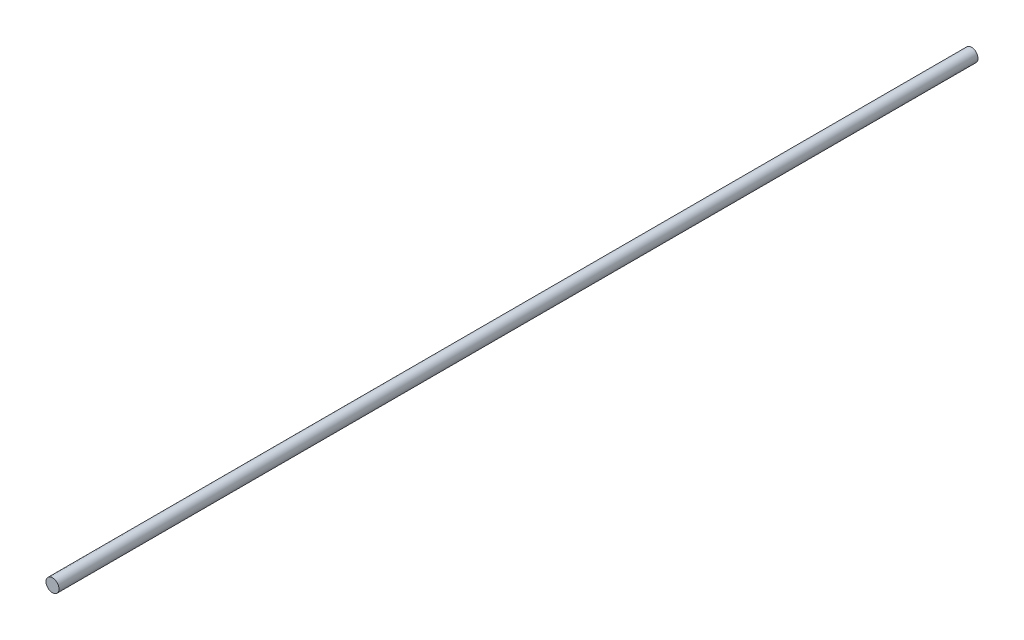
from build123d import *

# Parameters (mm, degrees)
SKETCH1_R           = 30
BOSS_EXTRUDE1_DEPTH = 4250


with BuildPart() as part:
    # Sketch1 → Boss-Extrude1 (new body)
    with BuildSketch(Plane.XY):
        Circle(SKETCH1_R)
    extrude(amount=-BOSS_EXTRUDE1_DEPTH)


solid = part.part
